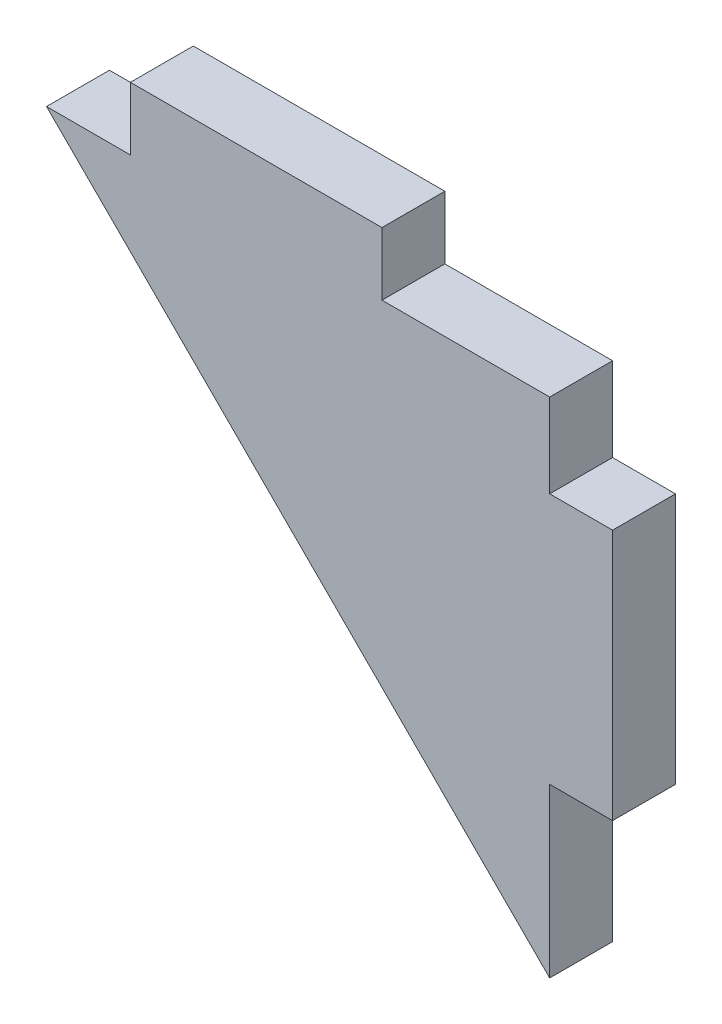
ISO-10303-21;
HEADER;
FILE_DESCRIPTION(('STEP AP214'),'2;1');
FILE_NAME('part.step','',(''),(''),'','','');
FILE_SCHEMA(('AUTOMOTIVE_DESIGN { 1 0 10303 214 1 1 1 1 }'));
ENDSEC;
DATA;
#1=APPLICATION_CONTEXT('core data for automotive mechanical design processes');
#2=APPLICATION_PROTOCOL_DEFINITION('international standard','automotive_design',2000,#1);
#3=PRODUCT_CONTEXT('',#1,'mechanical');
#4=PRODUCT('Part','Part','',(#3));
#5=PRODUCT_RELATED_PRODUCT_CATEGORY('part','',(#4));
#6=PRODUCT_DEFINITION_FORMATION('','',#4);
#7=PRODUCT_DEFINITION_CONTEXT('part definition',#1,'design');
#8=PRODUCT_DEFINITION('design','',#6,#7);
#9=PRODUCT_DEFINITION_SHAPE('','',#8);
#10=(LENGTH_UNIT() NAMED_UNIT(*) SI_UNIT(.MILLI.,.METRE.));
#11=(NAMED_UNIT(*) PLANE_ANGLE_UNIT() SI_UNIT($,.RADIAN.));
#12=(NAMED_UNIT(*) SI_UNIT($,.STERADIAN.) SOLID_ANGLE_UNIT());
#13=UNCERTAINTY_MEASURE_WITH_UNIT(LENGTH_MEASURE(1.E-05),#10,'distance_accuracy_value','');
#14=(GEOMETRIC_REPRESENTATION_CONTEXT(3) GLOBAL_UNCERTAINTY_ASSIGNED_CONTEXT((#13)) GLOBAL_UNIT_ASSIGNED_CONTEXT((#10,
#11,#12)) REPRESENTATION_CONTEXT('',''));
#15=CARTESIAN_POINT('',(0.,0.,0.));
#16=DIRECTION('',(0.,0.,1.));
#17=DIRECTION('',(1.,0.,0.));
#18=AXIS2_PLACEMENT_3D('',#15,#16,#17);
#19=CARTESIAN_POINT('',(-76.2,-76.2,19.05));
#20=DIRECTION('',(0.707106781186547,0.707106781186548,0.));
#21=DIRECTION('',(-0.707106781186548,0.707106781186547,0.));
#22=AXIS2_PLACEMENT_3D('',#19,#20,#21);
#23=PLANE('',#22);
#24=DIRECTION('',(0.707106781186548,-0.707106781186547,0.));
#25=VECTOR('',#24,1.);
#26=CARTESIAN_POINT('',(-76.2,-76.2,0.));
#27=LINE('',#26,#25);
#28=CARTESIAN_POINT('',(-152.4,0.,0.));
#29=VERTEX_POINT('',#28);
#30=CARTESIAN_POINT('',(0.,-152.4,0.));
#31=VERTEX_POINT('',#30);
#32=EDGE_CURVE('E166',#29,#31,#27,.T.);
#33=ORIENTED_EDGE('',*,*,#32,.T.);
#34=DIRECTION('',(0.,0.,-1.));
#35=VECTOR('',#34,1.);
#36=CARTESIAN_POINT('',(0.,-152.4,19.05));
#37=LINE('',#36,#35);
#38=CARTESIAN_POINT('',(0.,-152.4,19.05));
#39=VERTEX_POINT('',#38);
#40=EDGE_CURVE('E11',#39,#31,#37,.T.);
#41=ORIENTED_EDGE('',*,*,#40,.F.);
#42=DIRECTION('',(0.707106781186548,-0.707106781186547,0.));
#43=VECTOR('',#42,1.);
#44=CARTESIAN_POINT('',(-76.2,-76.2,19.05));
#45=LINE('',#44,#43);
#46=CARTESIAN_POINT('',(-152.4,0.,19.05));
#47=VERTEX_POINT('',#46);
#48=EDGE_CURVE('E243',#47,#39,#45,.T.);
#49=ORIENTED_EDGE('',*,*,#48,.F.);
#50=DIRECTION('',(0.,0.,-1.));
#51=VECTOR('',#50,1.);
#52=CARTESIAN_POINT('',(-152.4,0.,19.05));
#53=LINE('',#52,#51);
#54=EDGE_CURVE('E161',#47,#29,#53,.T.);
#55=ORIENTED_EDGE('',*,*,#54,.T.);
#56=EDGE_LOOP('',(#33,#41,#49,#55));
#57=FACE_BOUND('',#56,.T.);
#58=ADVANCED_FACE('F41',(#57),#23,.F.);
#59=CARTESIAN_POINT('',(0.,0.,19.05));
#60=DIRECTION('',(-1.,0.,0.));
#61=DIRECTION('',(0.,0.,1.));
#62=AXIS2_PLACEMENT_3D('',#59,#60,#61);
#63=PLANE('',#62);
#64=DIRECTION('',(0.,1.,0.));
#65=VECTOR('',#64,1.);
#66=CARTESIAN_POINT('',(0.,0.,0.));
#67=LINE('',#66,#65);
#68=CARTESIAN_POINT('',(0.,-101.6,0.));
#69=VERTEX_POINT('',#68);
#70=EDGE_CURVE('E170',#31,#69,#67,.T.);
#71=ORIENTED_EDGE('',*,*,#70,.T.);
#72=DIRECTION('',(0.,0.,-1.));
#73=VECTOR('',#72,1.);
#74=CARTESIAN_POINT('',(0.,-101.6,19.05));
#75=LINE('',#74,#73);
#76=CARTESIAN_POINT('',(0.,-101.6,19.05));
#77=VERTEX_POINT('',#76);
#78=EDGE_CURVE('E50',#77,#69,#75,.T.);
#79=ORIENTED_EDGE('',*,*,#78,.F.);
#80=DIRECTION('',(0.,1.,0.));
#81=VECTOR('',#80,1.);
#82=CARTESIAN_POINT('',(0.,0.,19.05));
#83=LINE('',#82,#81);
#84=EDGE_CURVE('E113',#39,#77,#83,.T.);
#85=ORIENTED_EDGE('',*,*,#84,.F.);
#86=ORIENTED_EDGE('',*,*,#40,.T.);
#87=EDGE_LOOP('',(#71,#79,#85,#86));
#88=FACE_BOUND('',#87,.T.);
#89=ADVANCED_FACE('F249',(#88),#63,.F.);
#90=CARTESIAN_POINT('',(0.,-101.6,19.05));
#91=DIRECTION('',(0.,1.,0.));
#92=DIRECTION('',(0.,0.,1.));
#93=AXIS2_PLACEMENT_3D('',#90,#91,#92);
#94=PLANE('',#93);
#95=DIRECTION('',(1.,0.,0.));
#96=VECTOR('',#95,1.);
#97=CARTESIAN_POINT('',(0.,-101.6,0.));
#98=LINE('',#97,#96);
#99=CARTESIAN_POINT('',(19.05,-101.6,0.));
#100=VERTEX_POINT('',#99);
#101=EDGE_CURVE('E173',#69,#100,#98,.T.);
#102=ORIENTED_EDGE('',*,*,#101,.T.);
#103=DIRECTION('',(0.,0.,-1.));
#104=VECTOR('',#103,1.);
#105=CARTESIAN_POINT('',(19.05,-101.6,19.05));
#106=LINE('',#105,#104);
#107=CARTESIAN_POINT('',(19.05,-101.6,19.05));
#108=VERTEX_POINT('',#107);
#109=EDGE_CURVE('E206',#108,#100,#106,.T.);
#110=ORIENTED_EDGE('',*,*,#109,.F.);
#111=DIRECTION('',(1.,0.,0.));
#112=VECTOR('',#111,1.);
#113=CARTESIAN_POINT('',(0.,-101.6,19.05));
#114=LINE('',#113,#112);
#115=EDGE_CURVE('E216',#77,#108,#114,.T.);
#116=ORIENTED_EDGE('',*,*,#115,.F.);
#117=ORIENTED_EDGE('',*,*,#78,.T.);
#118=EDGE_LOOP('',(#102,#110,#116,#117));
#119=FACE_BOUND('',#118,.T.);
#120=ADVANCED_FACE('F214',(#119),#94,.F.);
#121=CARTESIAN_POINT('',(19.05,0.,19.05));
#122=DIRECTION('',(1.,0.,0.));
#123=DIRECTION('',(0.,1.,0.));
#124=AXIS2_PLACEMENT_3D('',#121,#122,#123);
#125=PLANE('',#124);
#126=DIRECTION('',(0.,-1.,0.));
#127=VECTOR('',#126,1.);
#128=CARTESIAN_POINT('',(19.05,0.,0.));
#129=LINE('',#128,#127);
#130=CARTESIAN_POINT('',(19.05,-25.4,0.));
#131=VERTEX_POINT('',#130);
#132=EDGE_CURVE('E177',#131,#100,#129,.T.);
#133=ORIENTED_EDGE('',*,*,#132,.F.);
#134=DIRECTION('',(0.,0.,-1.));
#135=VECTOR('',#134,1.);
#136=CARTESIAN_POINT('',(19.05,-25.4,19.05));
#137=LINE('',#136,#135);
#138=CARTESIAN_POINT('',(19.05,-25.4,19.05));
#139=VERTEX_POINT('',#138);
#140=EDGE_CURVE('E204',#139,#131,#137,.T.);
#141=ORIENTED_EDGE('',*,*,#140,.F.);
#142=DIRECTION('',(0.,-1.,0.));
#143=VECTOR('',#142,1.);
#144=CARTESIAN_POINT('',(19.05,0.,19.05));
#145=LINE('',#144,#143);
#146=EDGE_CURVE('E227',#139,#108,#145,.T.);
#147=ORIENTED_EDGE('',*,*,#146,.T.);
#148=ORIENTED_EDGE('',*,*,#109,.T.);
#149=EDGE_LOOP('',(#133,#141,#147,#148));
#150=FACE_BOUND('',#149,.T.);
#151=ADVANCED_FACE('F224',(#150),#125,.T.);
#152=CARTESIAN_POINT('',(0.,-25.4,19.05));
#153=DIRECTION('',(0.,1.,0.));
#154=DIRECTION('',(0.,0.,1.));
#155=AXIS2_PLACEMENT_3D('',#152,#153,#154);
#156=PLANE('',#155);
#157=DIRECTION('',(1.,0.,0.));
#158=VECTOR('',#157,1.);
#159=CARTESIAN_POINT('',(0.,-25.4,0.));
#160=LINE('',#159,#158);
#161=CARTESIAN_POINT('',(0.,-25.4,0.));
#162=VERTEX_POINT('',#161);
#163=EDGE_CURVE('E180',#162,#131,#160,.T.);
#164=ORIENTED_EDGE('',*,*,#163,.F.);
#165=DIRECTION('',(0.,0.,-1.));
#166=VECTOR('',#165,1.);
#167=CARTESIAN_POINT('',(0.,-25.4,19.05));
#168=LINE('',#167,#166);
#169=CARTESIAN_POINT('',(0.,-25.4,19.05));
#170=VERTEX_POINT('',#169);
#171=EDGE_CURVE('E202',#170,#162,#168,.T.);
#172=ORIENTED_EDGE('',*,*,#171,.F.);
#173=DIRECTION('',(1.,0.,0.));
#174=VECTOR('',#173,1.);
#175=CARTESIAN_POINT('',(0.,-25.4,19.05));
#176=LINE('',#175,#174);
#177=EDGE_CURVE('E231',#170,#139,#176,.T.);
#178=ORIENTED_EDGE('',*,*,#177,.T.);
#179=ORIENTED_EDGE('',*,*,#140,.T.);
#180=EDGE_LOOP('',(#164,#172,#178,#179));
#181=FACE_BOUND('',#180,.T.);
#182=ADVANCED_FACE('F261',(#181),#156,.T.);
#183=CARTESIAN_POINT('',(0.,0.,0.));
#184=VERTEX_POINT('',#183);
#185=EDGE_CURVE('E174',#162,#184,#67,.T.);
#186=ORIENTED_EDGE('',*,*,#185,.T.);
#187=DIRECTION('',(0.,0.,-1.));
#188=VECTOR('',#187,1.);
#189=CARTESIAN_POINT('',(0.,0.,19.05));
#190=LINE('',#189,#188);
#191=CARTESIAN_POINT('',(0.,0.,19.05));
#192=VERTEX_POINT('',#191);
#193=EDGE_CURVE('E199',#192,#184,#190,.T.);
#194=ORIENTED_EDGE('',*,*,#193,.F.);
#195=EDGE_CURVE('E234',#170,#192,#83,.T.);
#196=ORIENTED_EDGE('',*,*,#195,.F.);
#197=ORIENTED_EDGE('',*,*,#171,.T.);
#198=EDGE_LOOP('',(#186,#194,#196,#197));
#199=FACE_BOUND('',#198,.T.);
#200=ADVANCED_FACE('F252',(#199),#63,.F.);
#201=CARTESIAN_POINT('',(0.,0.,19.05));
#202=DIRECTION('',(0.,-1.,0.));
#203=DIRECTION('',(1.,0.,0.));
#204=AXIS2_PLACEMENT_3D('',#201,#202,#203);
#205=PLANE('',#204);
#206=DIRECTION('',(-1.,0.,0.));
#207=VECTOR('',#206,1.);
#208=CARTESIAN_POINT('',(0.,0.,0.));
#209=LINE('',#208,#207);
#210=CARTESIAN_POINT('',(-50.8,0.,0.));
#211=VERTEX_POINT('',#210);
#212=EDGE_CURVE('E183',#184,#211,#209,.T.);
#213=ORIENTED_EDGE('',*,*,#212,.T.);
#214=DIRECTION('',(0.,0.,-1.));
#215=VECTOR('',#214,1.);
#216=CARTESIAN_POINT('',(-50.8,0.,19.05));
#217=LINE('',#216,#215);
#218=CARTESIAN_POINT('',(-50.8,0.,19.05));
#219=VERTEX_POINT('',#218);
#220=EDGE_CURVE('E196',#219,#211,#217,.T.);
#221=ORIENTED_EDGE('',*,*,#220,.F.);
#222=DIRECTION('',(-1.,0.,0.));
#223=VECTOR('',#222,1.);
#224=CARTESIAN_POINT('',(0.,0.,19.05));
#225=LINE('',#224,#223);
#226=EDGE_CURVE('E163',#192,#219,#225,.T.);
#227=ORIENTED_EDGE('',*,*,#226,.F.);
#228=ORIENTED_EDGE('',*,*,#193,.T.);
#229=EDGE_LOOP('',(#213,#221,#227,#228));
#230=FACE_BOUND('',#229,.T.);
#231=ADVANCED_FACE('F260',(#230),#205,.F.);
#232=CARTESIAN_POINT('',(-50.8,0.,19.05));
#233=DIRECTION('',(-1.,0.,0.));
#234=DIRECTION('',(0.,0.,1.));
#235=AXIS2_PLACEMENT_3D('',#232,#233,#234);
#236=PLANE('',#235);
#237=DIRECTION('',(0.,1.,0.));
#238=VECTOR('',#237,1.);
#239=CARTESIAN_POINT('',(-50.8,0.,0.));
#240=LINE('',#239,#238);
#241=CARTESIAN_POINT('',(-50.8,19.05,0.));
#242=VERTEX_POINT('',#241);
#243=EDGE_CURVE('E185',#211,#242,#240,.T.);
#244=ORIENTED_EDGE('',*,*,#243,.T.);
#245=DIRECTION('',(0.,0.,-1.));
#246=VECTOR('',#245,1.);
#247=CARTESIAN_POINT('',(-50.8,19.05,19.05));
#248=LINE('',#247,#246);
#249=CARTESIAN_POINT('',(-50.8,19.05,19.05));
#250=VERTEX_POINT('',#249);
#251=EDGE_CURVE('E147',#250,#242,#248,.T.);
#252=ORIENTED_EDGE('',*,*,#251,.F.);
#253=DIRECTION('',(0.,1.,0.));
#254=VECTOR('',#253,1.);
#255=CARTESIAN_POINT('',(-50.8,0.,19.05));
#256=LINE('',#255,#254);
#257=EDGE_CURVE('E152',#219,#250,#256,.T.);
#258=ORIENTED_EDGE('',*,*,#257,.F.);
#259=ORIENTED_EDGE('',*,*,#220,.T.);
#260=EDGE_LOOP('',(#244,#252,#258,#259));
#261=FACE_BOUND('',#260,.T.);
#262=ADVANCED_FACE('F267',(#261),#236,.F.);
#263=CARTESIAN_POINT('',(0.,19.05,19.05));
#264=DIRECTION('',(0.,1.,0.));
#265=DIRECTION('',(0.,0.,1.));
#266=AXIS2_PLACEMENT_3D('',#263,#264,#265);
#267=PLANE('',#266);
#268=DIRECTION('',(1.,0.,0.));
#269=VECTOR('',#268,1.);
#270=CARTESIAN_POINT('',(0.,19.05,0.));
#271=LINE('',#270,#269);
#272=CARTESIAN_POINT('',(-127.,19.05,0.));
#273=VERTEX_POINT('',#272);
#274=EDGE_CURVE('E142',#273,#242,#271,.T.);
#275=ORIENTED_EDGE('',*,*,#274,.F.);
#276=DIRECTION('',(0.,0.,-1.));
#277=VECTOR('',#276,1.);
#278=CARTESIAN_POINT('',(-127.,19.05,19.05));
#279=LINE('',#278,#277);
#280=CARTESIAN_POINT('',(-127.,19.05,19.05));
#281=VERTEX_POINT('',#280);
#282=EDGE_CURVE('E137',#281,#273,#279,.T.);
#283=ORIENTED_EDGE('',*,*,#282,.F.);
#284=DIRECTION('',(1.,0.,0.));
#285=VECTOR('',#284,1.);
#286=CARTESIAN_POINT('',(0.,19.05,19.05));
#287=LINE('',#286,#285);
#288=EDGE_CURVE('E140',#281,#250,#287,.T.);
#289=ORIENTED_EDGE('',*,*,#288,.T.);
#290=ORIENTED_EDGE('',*,*,#251,.T.);
#291=EDGE_LOOP('',(#275,#283,#289,#290));
#292=FACE_BOUND('',#291,.T.);
#293=ADVANCED_FACE('F139',(#292),#267,.T.);
#294=CARTESIAN_POINT('',(-127.,0.,19.05));
#295=DIRECTION('',(-1.,0.,0.));
#296=DIRECTION('',(0.,0.,1.));
#297=AXIS2_PLACEMENT_3D('',#294,#295,#296);
#298=PLANE('',#297);
#299=DIRECTION('',(0.,1.,0.));
#300=VECTOR('',#299,1.);
#301=CARTESIAN_POINT('',(-127.,0.,0.));
#302=LINE('',#301,#300);
#303=CARTESIAN_POINT('',(-127.,0.,0.));
#304=VERTEX_POINT('',#303);
#305=EDGE_CURVE('E189',#304,#273,#302,.T.);
#306=ORIENTED_EDGE('',*,*,#305,.F.);
#307=DIRECTION('',(0.,0.,-1.));
#308=VECTOR('',#307,1.);
#309=CARTESIAN_POINT('',(-127.,0.,19.05));
#310=LINE('',#309,#308);
#311=CARTESIAN_POINT('',(-127.,0.,19.05));
#312=VERTEX_POINT('',#311);
#313=EDGE_CURVE('E100',#312,#304,#310,.T.);
#314=ORIENTED_EDGE('',*,*,#313,.F.);
#315=DIRECTION('',(0.,1.,0.));
#316=VECTOR('',#315,1.);
#317=CARTESIAN_POINT('',(-127.,0.,19.05));
#318=LINE('',#317,#316);
#319=EDGE_CURVE('E150',#312,#281,#318,.T.);
#320=ORIENTED_EDGE('',*,*,#319,.T.);
#321=ORIENTED_EDGE('',*,*,#282,.T.);
#322=EDGE_LOOP('',(#306,#314,#320,#321));
#323=FACE_BOUND('',#322,.T.);
#324=ADVANCED_FACE('F156',(#323),#298,.T.);
#325=EDGE_CURVE('E103',#304,#29,#209,.T.);
#326=ORIENTED_EDGE('',*,*,#325,.T.);
#327=ORIENTED_EDGE('',*,*,#54,.F.);
#328=EDGE_CURVE('E60',#312,#47,#225,.T.);
#329=ORIENTED_EDGE('',*,*,#328,.F.);
#330=ORIENTED_EDGE('',*,*,#313,.T.);
#331=EDGE_LOOP('',(#326,#327,#329,#330));
#332=FACE_BOUND('',#331,.T.);
#333=ADVANCED_FACE('F270',(#332),#205,.F.);
#334=CARTESIAN_POINT('',(0.,0.,19.05));
#335=DIRECTION('',(0.,0.,1.));
#336=DIRECTION('',(1.,0.,0.));
#337=AXIS2_PLACEMENT_3D('',#334,#335,#336);
#338=PLANE('',#337);
#339=ORIENTED_EDGE('',*,*,#48,.T.);
#340=ORIENTED_EDGE('',*,*,#84,.T.);
#341=ORIENTED_EDGE('',*,*,#115,.T.);
#342=ORIENTED_EDGE('',*,*,#146,.F.);
#343=ORIENTED_EDGE('',*,*,#177,.F.);
#344=ORIENTED_EDGE('',*,*,#195,.T.);
#345=ORIENTED_EDGE('',*,*,#226,.T.);
#346=ORIENTED_EDGE('',*,*,#257,.T.);
#347=ORIENTED_EDGE('',*,*,#288,.F.);
#348=ORIENTED_EDGE('',*,*,#319,.F.);
#349=ORIENTED_EDGE('',*,*,#328,.T.);
#350=EDGE_LOOP('',(#339,#340,#341,#342,#343,#344,#345,#346,#347,#348,#349));
#351=FACE_BOUND('',#350,.T.);
#352=ADVANCED_FACE('F149',(#351),#338,.T.);
#353=CARTESIAN_POINT('',(0.,0.,0.));
#354=DIRECTION('',(0.,0.,1.));
#355=DIRECTION('',(1.,0.,0.));
#356=AXIS2_PLACEMENT_3D('',#353,#354,#355);
#357=PLANE('',#356);
#358=ORIENTED_EDGE('',*,*,#32,.F.);
#359=ORIENTED_EDGE('',*,*,#325,.F.);
#360=ORIENTED_EDGE('',*,*,#305,.T.);
#361=ORIENTED_EDGE('',*,*,#274,.T.);
#362=ORIENTED_EDGE('',*,*,#243,.F.);
#363=ORIENTED_EDGE('',*,*,#212,.F.);
#364=ORIENTED_EDGE('',*,*,#185,.F.);
#365=ORIENTED_EDGE('',*,*,#163,.T.);
#366=ORIENTED_EDGE('',*,*,#132,.T.);
#367=ORIENTED_EDGE('',*,*,#101,.F.);
#368=ORIENTED_EDGE('',*,*,#70,.F.);
#369=EDGE_LOOP('',(#358,#359,#360,#361,#362,#363,#364,#365,#366,#367,#368));
#370=FACE_BOUND('',#369,.T.);
#371=ADVANCED_FACE('F219',(#370),#357,.F.);
#372=CLOSED_SHELL('',(#58,#89,#120,#151,#182,#200,#231,#262,#293,#324,#333,#352,#371));
#373=MANIFOLD_SOLID_BREP('B2',#372);
#374=ADVANCED_BREP_SHAPE_REPRESENTATION('',(#18,#373),#14);
#375=SHAPE_DEFINITION_REPRESENTATION(#9,#374);
ENDSEC;
END-ISO-10303-21;
